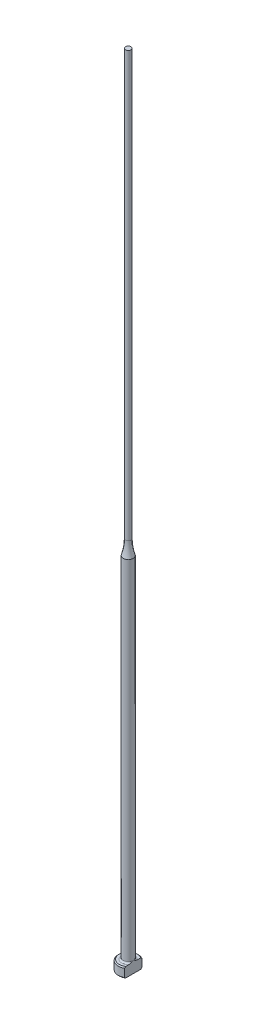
ISO-10303-21;
HEADER;
FILE_DESCRIPTION(('STEP AP214'),'2;1');
FILE_NAME('part.step','',(''),(''),'','','');
FILE_SCHEMA(('AUTOMOTIVE_DESIGN { 1 0 10303 214 1 1 1 1 }'));
ENDSEC;
DATA;
#1=APPLICATION_CONTEXT('core data for automotive mechanical design processes');
#2=APPLICATION_PROTOCOL_DEFINITION('international standard','automotive_design',2000,#1);
#3=PRODUCT_CONTEXT('',#1,'mechanical');
#4=PRODUCT('Part','Part','',(#3));
#5=PRODUCT_RELATED_PRODUCT_CATEGORY('part','',(#4));
#6=PRODUCT_DEFINITION_FORMATION('','',#4);
#7=PRODUCT_DEFINITION_CONTEXT('part definition',#1,'design');
#8=PRODUCT_DEFINITION('design','',#6,#7);
#9=PRODUCT_DEFINITION_SHAPE('','',#8);
#10=(LENGTH_UNIT() NAMED_UNIT(*) SI_UNIT(.MILLI.,.METRE.));
#11=(NAMED_UNIT(*) PLANE_ANGLE_UNIT() SI_UNIT($,.RADIAN.));
#12=(NAMED_UNIT(*) SI_UNIT($,.STERADIAN.) SOLID_ANGLE_UNIT());
#13=UNCERTAINTY_MEASURE_WITH_UNIT(LENGTH_MEASURE(1.E-05),#10,'distance_accuracy_value','');
#14=(GEOMETRIC_REPRESENTATION_CONTEXT(3) GLOBAL_UNCERTAINTY_ASSIGNED_CONTEXT((#13)) GLOBAL_UNIT_ASSIGNED_CONTEXT((#10,
#11,#12)) REPRESENTATION_CONTEXT('',''));
#15=CARTESIAN_POINT('',(0.,0.,0.));
#16=DIRECTION('',(0.,0.,1.));
#17=DIRECTION('',(1.,0.,0.));
#18=AXIS2_PLACEMENT_3D('',#15,#16,#17);
#19=CARTESIAN_POINT('',(-1.99999999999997,2.,0.));
#20=DIRECTION('',(0.,1.,0.));
#21=DIRECTION('',(0.,0.,1.));
#22=AXIS2_PLACEMENT_3D('',#19,#20,#21);
#23=PLANE('',#22);
#24=CARTESIAN_POINT('',(0.,2.,0.));
#25=DIRECTION('',(0.,1.,0.));
#26=DIRECTION('',(0.,0.,1.));
#27=AXIS2_PLACEMENT_3D('',#24,#25,#26);
#28=CIRCLE('',#27,1.79999999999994);
#29=CARTESIAN_POINT('',(0.999999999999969,2.,-1.49666295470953));
#30=VERTEX_POINT('',#29);
#31=CARTESIAN_POINT('',(0.999999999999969,2.,1.49666295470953));
#32=VERTEX_POINT('',#31);
#33=EDGE_CURVE('E187',#30,#32,#28,.T.);
#34=ORIENTED_EDGE('',*,*,#33,.T.);
#35=DIRECTION('',(0.,0.,-1.));
#36=VECTOR('',#35,1.);
#37=CARTESIAN_POINT('',(0.999999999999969,2.,0.));
#38=LINE('',#37,#36);
#39=CARTESIAN_POINT('',(0.999999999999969,2.00000000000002,0.830662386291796));
#40=VERTEX_POINT('',#39);
#41=EDGE_CURVE('E57',#32,#40,#38,.T.);
#42=ORIENTED_EDGE('',*,*,#41,.T.);
#43=CARTESIAN_POINT('',(0.,2.,0.));
#44=DIRECTION('',(0.,1.,0.));
#45=DIRECTION('',(0.,0.,1.));
#46=AXIS2_PLACEMENT_3D('',#43,#44,#45);
#47=CIRCLE('',#46,1.29999999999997);
#48=CARTESIAN_POINT('',(0.999999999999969,2.00000000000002,-0.830662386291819));
#49=VERTEX_POINT('',#48);
#50=EDGE_CURVE('E108',#40,#49,#47,.F.);
#51=ORIENTED_EDGE('',*,*,#50,.T.);
#52=EDGE_CURVE('E137',#49,#30,#38,.T.);
#53=ORIENTED_EDGE('',*,*,#52,.T.);
#54=EDGE_LOOP('',(#34,#42,#51,#53));
#55=FACE_BOUND('',#54,.T.);
#56=ADVANCED_FACE('F32',(#55),#23,.T.);
#57=CARTESIAN_POINT('',(0.,259.958771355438,0.));
#58=DIRECTION('',(0.,1.,0.));
#59=DIRECTION('',(0.,0.,1.));
#60=AXIS2_PLACEMENT_3D('',#57,#58,#59);
#61=CYLINDRICAL_SURFACE('',#60,1.99999999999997);
#62=CARTESIAN_POINT('',(0.,1.79999999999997,0.));
#63=DIRECTION('',(0.,1.,0.));
#64=DIRECTION('',(0.,0.,1.));
#65=AXIS2_PLACEMENT_3D('',#62,#63,#64);
#66=CIRCLE('',#65,1.99999999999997);
#67=CARTESIAN_POINT('',(0.999999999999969,1.79999999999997,1.73205080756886));
#68=VERTEX_POINT('',#67);
#69=CARTESIAN_POINT('',(0.999999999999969,1.79999999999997,-1.73205080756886));
#70=VERTEX_POINT('',#69);
#71=EDGE_CURVE('E105',#68,#70,#66,.F.);
#72=ORIENTED_EDGE('',*,*,#71,.T.);
#73=DIRECTION('',(0.,-1.,0.));
#74=VECTOR('',#73,1.);
#75=CARTESIAN_POINT('',(0.999999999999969,160.,-1.73205080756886));
#76=LINE('',#75,#74);
#77=CARTESIAN_POINT('',(0.999999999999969,0.199999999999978,-1.73205080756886));
#78=VERTEX_POINT('',#77);
#79=EDGE_CURVE('E193',#70,#78,#76,.T.);
#80=ORIENTED_EDGE('',*,*,#79,.T.);
#81=CARTESIAN_POINT('',(0.,0.199999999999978,0.));
#82=DIRECTION('',(0.,-1.,0.));
#83=DIRECTION('',(0.,0.,-1.));
#84=AXIS2_PLACEMENT_3D('',#81,#82,#83);
#85=CIRCLE('',#84,1.99999999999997);
#86=CARTESIAN_POINT('',(0.999999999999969,0.199999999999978,1.73205080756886));
#87=VERTEX_POINT('',#86);
#88=EDGE_CURVE('E100',#78,#87,#85,.F.);
#89=ORIENTED_EDGE('',*,*,#88,.T.);
#90=DIRECTION('',(0.,-1.,0.));
#91=VECTOR('',#90,1.);
#92=CARTESIAN_POINT('',(0.999999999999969,160.,1.73205080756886));
#93=LINE('',#92,#91);
#94=EDGE_CURVE('E93',#68,#87,#93,.T.);
#95=ORIENTED_EDGE('',*,*,#94,.F.);
#96=EDGE_LOOP('',(#72,#80,#89,#95));
#97=FACE_BOUND('',#96,.T.);
#98=ADVANCED_FACE('F158',(#97),#61,.T.);
#99=CARTESIAN_POINT('',(0.,0.,0.));
#100=DIRECTION('',(0.,-1.,0.));
#101=DIRECTION('',(0.,0.,-1.));
#102=AXIS2_PLACEMENT_3D('',#99,#100,#101);
#103=PLANE('',#102);
#104=CARTESIAN_POINT('',(0.,0.,0.));
#105=DIRECTION('',(0.,-1.,0.));
#106=DIRECTION('',(0.,0.,-1.));
#107=AXIS2_PLACEMENT_3D('',#104,#105,#106);
#108=CIRCLE('',#107,1.79999999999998);
#109=CARTESIAN_POINT('',(0.999999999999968,0.,1.49666295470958));
#110=VERTEX_POINT('',#109);
#111=CARTESIAN_POINT('',(0.999999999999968,0.,-1.49666295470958));
#112=VERTEX_POINT('',#111);
#113=EDGE_CURVE('E98',#110,#112,#108,.T.);
#114=ORIENTED_EDGE('',*,*,#113,.T.);
#115=DIRECTION('',(0.,0.,1.));
#116=VECTOR('',#115,1.);
#117=CARTESIAN_POINT('',(0.999999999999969,0.,-1.73205080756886));
#118=LINE('',#117,#116);
#119=EDGE_CURVE('E83',#112,#110,#118,.T.);
#120=ORIENTED_EDGE('',*,*,#119,.T.);
#121=EDGE_LOOP('',(#114,#120));
#122=FACE_BOUND('',#121,.T.);
#123=ADVANCED_FACE('F103',(#122),#103,.T.);
#124=CARTESIAN_POINT('',(0.,2.,0.));
#125=DIRECTION('',(0.,-1.,0.));
#126=DIRECTION('',(0.,0.,-1.));
#127=AXIS2_PLACEMENT_3D('',#124,#125,#126);
#128=CONICAL_SURFACE('',#127,1.79999999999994,0.785398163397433);
#129=ORIENTED_EDGE('',*,*,#71,.F.);
#130=CARTESIAN_POINT('',(0.999999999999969,-0.143084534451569,3.81417299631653));
#131=CARTESIAN_POINT('',(0.999999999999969,-0.0593997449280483,3.72765647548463));
#132=CARTESIAN_POINT('',(0.999999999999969,0.0241940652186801,3.64105173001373));
#133=CARTESIAN_POINT('',(0.999999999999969,0.191148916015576,3.46761616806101));
#134=CARTESIAN_POINT('',(0.999999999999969,0.274509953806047,3.3807853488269));
#135=CARTESIAN_POINT('',(0.999999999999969,0.524249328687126,3.11979400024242));
#136=CARTESIAN_POINT('',(0.999999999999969,0.690198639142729,2.94522254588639));
#137=CARTESIAN_POINT('',(0.999999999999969,1.01697550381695,2.59782670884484));
#138=CARTESIAN_POINT('',(0.999999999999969,1.17783928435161,2.42503661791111));
#139=CARTESIAN_POINT('',(0.999999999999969,1.41669118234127,2.16364984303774));
#140=CARTESIAN_POINT('',(0.999999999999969,1.49589273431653,2.07616357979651));
#141=CARTESIAN_POINT('',(0.999999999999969,1.65313803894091,1.90015721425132));
#142=CARTESIAN_POINT('',(0.999999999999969,1.73118183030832,1.81163714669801));
#143=CARTESIAN_POINT('',(0.999999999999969,1.85567318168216,1.66767927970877));
#144=CARTESIAN_POINT('',(0.999999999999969,1.90265415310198,1.61270332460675));
#145=CARTESIAN_POINT('',(0.999999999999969,1.99577882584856,1.50203557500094));
#146=CARTESIAN_POINT('',(0.999999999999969,2.04192244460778,1.44634371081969));
#147=CARTESIAN_POINT('',(0.999999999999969,2.13356596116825,1.33345480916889));
#148=CARTESIAN_POINT('',(0.999999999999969,2.17905399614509,1.2762481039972));
#149=CARTESIAN_POINT('',(0.999999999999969,2.26844283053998,1.16060976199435));
#150=CARTESIAN_POINT('',(0.999999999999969,2.3123437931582,1.10217825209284));
#151=CARTESIAN_POINT('',(0.999999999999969,2.39853453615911,0.982773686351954));
#152=CARTESIAN_POINT('',(0.999999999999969,2.44078986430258,0.921775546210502));
#153=CARTESIAN_POINT('',(0.999999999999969,2.52187810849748,0.797387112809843));
#154=CARTESIAN_POINT('',(0.999999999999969,2.56070631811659,0.733993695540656));
#155=CARTESIAN_POINT('',(0.999999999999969,2.6324859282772,0.604932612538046));
#156=CARTESIAN_POINT('',(0.999999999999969,2.66550424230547,0.539302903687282));
#157=CARTESIAN_POINT('',(0.999999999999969,2.72301550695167,0.404437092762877));
#158=CARTESIAN_POINT('',(0.999999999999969,2.74753707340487,0.335214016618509));
#159=CARTESIAN_POINT('',(0.999999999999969,2.77407110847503,0.231400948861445));
#160=CARTESIAN_POINT('',(0.999999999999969,2.78110742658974,0.198093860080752));
#161=CARTESIAN_POINT('',(0.999999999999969,2.79200506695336,0.130954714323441));
#162=CARTESIAN_POINT('',(0.999999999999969,2.7958666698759,0.0971227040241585));
#163=CARTESIAN_POINT('',(0.999999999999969,2.80013905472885,0.0293410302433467));
#164=CARTESIAN_POINT('',(0.999999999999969,2.80056046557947,-0.00460794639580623));
#165=CARTESIAN_POINT('',(0.999999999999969,2.79795882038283,-0.0723663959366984));
#166=CARTESIAN_POINT('',(0.999999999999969,2.79493547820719,-0.106175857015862));
#167=CARTESIAN_POINT('',(0.999999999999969,2.78105481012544,-0.206326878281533));
#168=CARTESIAN_POINT('',(0.999999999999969,2.76542146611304,-0.272037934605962));
#169=CARTESIAN_POINT('',(0.999999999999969,2.73477554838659,-0.368312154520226));
#170=CARTESIAN_POINT('',(0.999999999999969,2.72331063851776,-0.40012349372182));
#171=CARTESIAN_POINT('',(0.999999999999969,2.69840546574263,-0.46296441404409));
#172=CARTESIAN_POINT('',(0.999999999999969,2.68496560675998,-0.493994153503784));
#173=CARTESIAN_POINT('',(0.999999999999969,2.64209309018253,-0.586298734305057));
#174=CARTESIAN_POINT('',(0.999999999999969,2.61022871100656,-0.64643570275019));
#175=CARTESIAN_POINT('',(0.999999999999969,2.5422853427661,-0.764304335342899));
#176=CARTESIAN_POINT('',(0.999999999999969,2.50620119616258,-0.822032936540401));
#177=CARTESIAN_POINT('',(0.999999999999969,2.43107084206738,-0.935840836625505));
#178=CARTESIAN_POINT('',(0.999999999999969,2.39201347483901,-0.991912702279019));
#179=CARTESIAN_POINT('',(0.999999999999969,2.31195870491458,-1.10259849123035));
#180=CARTESIAN_POINT('',(0.999999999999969,2.27096226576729,-1.15721311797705));
#181=CARTESIAN_POINT('',(0.999999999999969,2.18701695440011,-1.26606869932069));
#182=CARTESIAN_POINT('',(0.999999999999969,2.14404946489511,-1.32029522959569));
#183=CARTESIAN_POINT('',(0.999999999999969,2.0570505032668,-1.4278898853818));
#184=CARTESIAN_POINT('',(0.999999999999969,2.01301896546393,-1.48125795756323));
#185=CARTESIAN_POINT('',(0.999999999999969,1.87995068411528,-1.64010952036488));
#186=CARTESIAN_POINT('',(0.999999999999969,1.78973357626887,-1.74460261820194));
#187=CARTESIAN_POINT('',(0.999999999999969,1.62290341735,-1.93426834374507));
#188=CARTESIAN_POINT('',(0.999999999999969,1.54658658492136,-2.01970404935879));
#189=CARTESIAN_POINT('',(0.999999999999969,1.39301250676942,-2.18973019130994));
#190=CARTESIAN_POINT('',(0.999999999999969,1.31575523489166,-2.27432060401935));
#191=CARTESIAN_POINT('',(0.999999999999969,1.08283440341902,-2.52732479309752));
#192=CARTESIAN_POINT('',(0.999999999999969,0.926165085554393,-2.69481086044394));
#193=CARTESIAN_POINT('',(0.999999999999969,0.617772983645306,-3.02147252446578));
#194=CARTESIAN_POINT('',(0.999999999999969,0.466111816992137,-3.18070657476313));
#195=CARTESIAN_POINT('',(0.999999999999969,0.238015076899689,-3.41880818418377));
#196=CARTESIAN_POINT('',(0.999999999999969,0.1619245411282,-3.49800657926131));
#197=CARTESIAN_POINT('',(0.999999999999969,0.00955322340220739,-3.65621892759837));
#198=CARTESIAN_POINT('',(0.999999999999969,-0.0667275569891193,-3.73523288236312));
#199=CARTESIAN_POINT('',(0.999999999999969,-0.14308453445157,-3.81417299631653));
#200=B_SPLINE_CURVE_WITH_KNOTS('',3,(#130,#131,#132,#133,#134,#135,#136,#137,#138,#139,#140,
#141,#142,#143,#144,#145,#146,#147,#148,#149,#150,#151,#152,#153,#154,#155,#156,#157,#158,#159,
#160,#161,#162,#163,#164,#165,#166,#167,#168,#169,#170,#171,#172,#173,#174,#175,#176,#177,#178,
#179,#180,#181,#182,#183,#184,#185,#186,#187,#188,#189,#190,#191,#192,#193,#194,#195,#196,#197,
#198,#199),.UNSPECIFIED.,.F.,.F.,(4,2,2,2,2,2,2,2,2,2,2,2,2,2,2,2,2,2,2,2,2,2,2,2,2,2,2,2,2,2,2,
2,2,2,4),(0.,0.36110162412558,0.722207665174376,1.44478731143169,2.15299784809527,
2.5070263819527,2.8610430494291,3.07798416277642,3.29494655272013,3.51418925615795,
3.73340935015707,3.95594813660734,4.17878792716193,4.39886399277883,4.61819150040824,
4.72018864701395,4.82217677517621,4.92384967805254,5.02553102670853,5.22698459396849,
5.32838854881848,5.4297717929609,5.63365200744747,5.837784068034,6.04272417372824,
6.24756349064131,6.45510395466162,6.66265726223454,7.07676259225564,7.42043039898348,
7.76410778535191,8.45210822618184,9.11180822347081,9.44129145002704,9.77077197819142),.UNSPECIFIED.);
#201=EDGE_CURVE('E136',#68,#32,#200,.T.);
#202=ORIENTED_EDGE('',*,*,#201,.T.);
#203=ORIENTED_EDGE('',*,*,#33,.F.);
#204=EDGE_CURVE('E128',#30,#70,#200,.T.);
#205=ORIENTED_EDGE('',*,*,#204,.T.);
#206=EDGE_LOOP('',(#129,#202,#203,#205));
#207=FACE_BOUND('',#206,.T.);
#208=ADVANCED_FACE('F144',(#207),#128,.T.);
#209=CARTESIAN_POINT('',(0.,0.199999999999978,0.));
#210=DIRECTION('',(0.,1.,0.));
#211=DIRECTION('',(0.,0.,1.));
#212=AXIS2_PLACEMENT_3D('',#209,#210,#211);
#213=CONICAL_SURFACE('',#212,1.99999999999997,0.785398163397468);
#214=ORIENTED_EDGE('',*,*,#88,.F.);
#215=CARTESIAN_POINT('',(0.999999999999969,2.14308453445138,-3.81417299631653));
#216=CARTESIAN_POINT('',(0.999999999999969,2.05939974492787,-3.72765647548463));
#217=CARTESIAN_POINT('',(0.999999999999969,1.97580593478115,-3.64105173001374));
#218=CARTESIAN_POINT('',(0.999999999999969,1.80885108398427,-3.46761616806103));
#219=CARTESIAN_POINT('',(0.999999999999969,1.72549004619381,-3.38078534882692));
#220=CARTESIAN_POINT('',(0.999999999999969,1.47575067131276,-3.11979400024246));
#221=CARTESIAN_POINT('',(0.999999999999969,1.30980136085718,-2.94522254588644));
#222=CARTESIAN_POINT('',(0.999999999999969,0.983024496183,-2.5978267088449));
#223=CARTESIAN_POINT('',(0.999999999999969,0.822160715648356,-2.42503661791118));
#224=CARTESIAN_POINT('',(0.999999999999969,0.583308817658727,-2.16364984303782));
#225=CARTESIAN_POINT('',(0.999999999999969,0.50410726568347,-2.0761635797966));
#226=CARTESIAN_POINT('',(0.999999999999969,0.346861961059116,-1.90015721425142));
#227=CARTESIAN_POINT('',(0.999999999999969,0.26881816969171,-1.81163714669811));
#228=CARTESIAN_POINT('',(0.999999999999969,0.144326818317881,-1.66767927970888));
#229=CARTESIAN_POINT('',(0.999999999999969,0.0973458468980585,-1.61270332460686));
#230=CARTESIAN_POINT('',(0.999999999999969,0.00422117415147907,-1.50203557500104));
#231=CARTESIAN_POINT('',(0.999999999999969,-0.0419224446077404,-1.44634371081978));
#232=CARTESIAN_POINT('',(0.999999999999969,-0.133565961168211,-1.33345480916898));
#233=CARTESIAN_POINT('',(0.999999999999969,-0.179053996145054,-1.27624810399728));
#234=CARTESIAN_POINT('',(0.999999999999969,-0.268442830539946,-1.16060976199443));
#235=CARTESIAN_POINT('',(0.999999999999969,-0.31234379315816,-1.10217825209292));
#236=CARTESIAN_POINT('',(0.999999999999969,-0.398534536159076,-0.982773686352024));
#237=CARTESIAN_POINT('',(0.999999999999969,-0.440789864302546,-0.92177554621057));
#238=CARTESIAN_POINT('',(0.999999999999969,-0.521878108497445,-0.797387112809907));
#239=CARTESIAN_POINT('',(0.999999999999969,-0.560706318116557,-0.733993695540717));
#240=CARTESIAN_POINT('',(0.999999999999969,-0.632485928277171,-0.604932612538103));
#241=CARTESIAN_POINT('',(0.999999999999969,-0.665504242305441,-0.539302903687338));
#242=CARTESIAN_POINT('',(0.999999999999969,-0.723015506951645,-0.404437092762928));
#243=CARTESIAN_POINT('',(0.999999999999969,-0.747537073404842,-0.335214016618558));
#244=CARTESIAN_POINT('',(0.999999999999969,-0.774071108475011,-0.231400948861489));
#245=CARTESIAN_POINT('',(0.999999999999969,-0.781107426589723,-0.198093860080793));
#246=CARTESIAN_POINT('',(0.999999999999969,-0.792005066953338,-0.130954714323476));
#247=CARTESIAN_POINT('',(0.999999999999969,-0.795866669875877,-0.0971227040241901));
#248=CARTESIAN_POINT('',(0.999999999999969,-0.800139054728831,-0.0293410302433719));
#249=CARTESIAN_POINT('',(0.999999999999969,-0.80056046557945,0.00460794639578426));
#250=CARTESIAN_POINT('',(0.999999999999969,-0.797958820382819,0.0723663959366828));
#251=CARTESIAN_POINT('',(0.999999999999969,-0.794935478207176,0.106175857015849));
#252=CARTESIAN_POINT('',(0.999999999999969,-0.781054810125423,0.20632687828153));
#253=CARTESIAN_POINT('',(0.999999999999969,-0.765421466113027,0.272037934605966));
#254=CARTESIAN_POINT('',(0.999999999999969,-0.734775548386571,0.36831215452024));
#255=CARTESIAN_POINT('',(0.999999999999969,-0.723310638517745,0.400123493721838));
#256=CARTESIAN_POINT('',(0.999999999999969,-0.698405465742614,0.462964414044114));
#257=CARTESIAN_POINT('',(0.999999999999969,-0.684965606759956,0.493994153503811));
#258=CARTESIAN_POINT('',(0.999999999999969,-0.642093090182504,0.586298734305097));
#259=CARTESIAN_POINT('',(0.999999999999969,-0.610228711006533,0.646435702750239));
#260=CARTESIAN_POINT('',(0.999999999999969,-0.542285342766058,0.764304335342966));
#261=CARTESIAN_POINT('',(0.999999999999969,-0.506201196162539,0.822032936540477));
#262=CARTESIAN_POINT('',(0.999999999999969,-0.431070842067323,0.935840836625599));
#263=CARTESIAN_POINT('',(0.999999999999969,-0.392013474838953,0.991912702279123));
#264=CARTESIAN_POINT('',(0.999999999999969,-0.311958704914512,1.10259849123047));
#265=CARTESIAN_POINT('',(0.999999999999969,-0.270962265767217,1.15721311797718));
#266=CARTESIAN_POINT('',(0.999999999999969,-0.187016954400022,1.26606869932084));
#267=CARTESIAN_POINT('',(0.999999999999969,-0.144049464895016,1.32029522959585));
#268=CARTESIAN_POINT('',(0.999999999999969,-0.0570505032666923,1.42788988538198));
#269=CARTESIAN_POINT('',(0.999999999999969,-0.0130189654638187,1.48125795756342));
#270=CARTESIAN_POINT('',(0.999999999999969,0.120049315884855,1.64010952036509));
#271=CARTESIAN_POINT('',(0.999999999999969,0.21026642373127,1.74460261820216));
#272=CARTESIAN_POINT('',(0.999999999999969,0.37709658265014,1.9342683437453));
#273=CARTESIAN_POINT('',(0.999999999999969,0.453413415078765,2.01970404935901));
#274=CARTESIAN_POINT('',(0.999999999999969,0.606987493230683,2.18973019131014));
#275=CARTESIAN_POINT('',(0.999999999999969,0.684244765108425,2.27432060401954));
#276=CARTESIAN_POINT('',(0.999999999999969,0.917165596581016,2.52732479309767));
#277=CARTESIAN_POINT('',(0.999999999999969,1.07383491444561,2.69481086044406));
#278=CARTESIAN_POINT('',(0.999999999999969,1.38222701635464,3.02147252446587));
#279=CARTESIAN_POINT('',(0.999999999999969,1.53388818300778,3.1807065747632));
#280=CARTESIAN_POINT('',(0.999999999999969,1.76198492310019,3.41880818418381));
#281=CARTESIAN_POINT('',(0.999999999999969,1.83807545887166,3.49800657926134));
#282=CARTESIAN_POINT('',(0.999999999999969,1.99044677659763,3.65621892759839));
#283=CARTESIAN_POINT('',(0.999999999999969,2.06672755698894,3.73523288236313));
#284=CARTESIAN_POINT('',(0.999999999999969,2.14308453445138,3.81417299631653));
#285=B_SPLINE_CURVE_WITH_KNOTS('',3,(#215,#216,#217,#218,#219,#220,#221,#222,#223,#224,#225,
#226,#227,#228,#229,#230,#231,#232,#233,#234,#235,#236,#237,#238,#239,#240,#241,#242,#243,#244,
#245,#246,#247,#248,#249,#250,#251,#252,#253,#254,#255,#256,#257,#258,#259,#260,#261,#262,#263,
#264,#265,#266,#267,#268,#269,#270,#271,#272,#273,#274,#275,#276,#277,#278,#279,#280,#281,#282,
#283,#284),.UNSPECIFIED.,.F.,.F.,(4,2,2,2,2,2,2,2,2,2,2,2,2,2,2,2,2,2,2,2,2,2,2,2,2,2,2,2,2,2,2,
2,2,2,4),(0.,0.36110162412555,0.722207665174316,1.44478731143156,2.15299784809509,
2.5070263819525,2.86104304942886,3.07798416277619,3.2949465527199,3.51418925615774,
3.73340935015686,3.95594813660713,4.17878792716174,4.39886399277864,4.61819150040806,
4.72018864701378,4.82217677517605,4.92384967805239,5.02553102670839,5.22698459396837,
5.32838854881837,5.4297717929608,5.6336520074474,5.83778406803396,6.04272417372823,
6.24756349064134,6.45510395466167,6.66265726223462,7.07676259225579,7.42043039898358,
7.76410778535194,8.45210822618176,9.11180822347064,9.44129145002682,9.77077197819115),.UNSPECIFIED.);
#286=EDGE_CURVE('E86',#78,#112,#285,.T.);
#287=ORIENTED_EDGE('',*,*,#286,.T.);
#288=ORIENTED_EDGE('',*,*,#113,.F.);
#289=EDGE_CURVE('E89',#110,#87,#285,.T.);
#290=ORIENTED_EDGE('',*,*,#289,.T.);
#291=EDGE_LOOP('',(#214,#287,#288,#290));
#292=FACE_BOUND('',#291,.T.);
#293=ADVANCED_FACE('F97',(#292),#213,.T.);
#294=CARTESIAN_POINT('',(0.,2.30000000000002,0.));
#295=DIRECTION('',(0.,1.,0.));
#296=DIRECTION('',(0.,0.,1.));
#297=AXIS2_PLACEMENT_3D('',#294,#295,#296);
#298=TOROIDAL_SURFACE('',#297,1.29999999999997,0.3);
#299=CARTESIAN_POINT('',(0.999999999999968,2.30000000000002,0.));
#300=CARTESIAN_POINT('',(0.999999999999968,2.30000064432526,8.6574445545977E-12));
#301=CARTESIAN_POINT('',(0.999999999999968,2.30000128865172,-9.05742231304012E-08));
#302=CARTESIAN_POINT('',(0.999999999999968,2.30000254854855,-3.98319620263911E-07));
#303=CARTESIAN_POINT('',(0.999999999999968,2.30000316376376,-6.16748313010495E-07));
#304=CARTESIAN_POINT('',(0.999999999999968,2.30000438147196,-1.15047367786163E-06));
#305=CARTESIAN_POINT('',(0.999999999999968,2.30000498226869,-1.46954564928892E-06));
#306=CARTESIAN_POINT('',(0.999999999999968,2.30000613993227,-2.17388585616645E-06));
#307=CARTESIAN_POINT('',(0.999999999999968,2.3000066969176,-2.55896592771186E-06));
#308=CARTESIAN_POINT('',(0.999999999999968,2.30000847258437,-3.89137454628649E-06));
#309=CARTESIAN_POINT('',(0.999999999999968,2.30000962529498,-4.9272569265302E-06));
#310=CARTESIAN_POINT('',(0.999999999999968,2.30001175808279,-7.12255376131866E-06));
#311=CARTESIAN_POINT('',(0.999999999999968,2.30001274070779,-8.27963246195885E-06));
#312=CARTESIAN_POINT('',(0.999999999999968,2.30001619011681,-1.25710396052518E-05));
#313=CARTESIAN_POINT('',(0.999999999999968,2.30001847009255,-1.58589994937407E-05));
#314=CARTESIAN_POINT('',(0.999999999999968,2.3000224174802,-2.25210462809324E-05));
#315=CARTESIAN_POINT('',(0.999999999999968,2.30002411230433,-2.58796667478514E-05));
#316=CARTESIAN_POINT('',(0.999999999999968,2.30003085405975,-3.94941957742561E-05));
#317=CARTESIAN_POINT('',(0.999999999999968,2.30003568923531,-4.98493079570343E-05));
#318=CARTESIAN_POINT('',(0.999999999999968,2.30004388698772,-6.96407730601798E-05));
#319=CARTESIAN_POINT('',(0.999999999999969,2.30004735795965,-7.903098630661E-05));
#320=CARTESIAN_POINT('',(0.999999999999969,2.30007348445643,-0.000144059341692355));
#321=CARTESIAN_POINT('',(0.999999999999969,2.30010510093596,-0.000195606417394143));
#322=CARTESIAN_POINT('',(0.999999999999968,2.30022061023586,-0.000391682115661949));
#323=CARTESIAN_POINT('',(0.999999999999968,2.3002978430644,-0.000539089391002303));
#324=CARTESIAN_POINT('',(0.999999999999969,2.30059433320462,-0.00109591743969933));
#325=CARTESIAN_POINT('',(0.999999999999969,2.30082052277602,-0.00150237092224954));
#326=CARTESIAN_POINT('',(0.999999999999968,2.30171558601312,-0.00311941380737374));
#327=CARTESIAN_POINT('',(0.999999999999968,2.30237677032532,-0.00433326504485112));
#328=CARTESIAN_POINT('',(0.999999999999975,2.31602135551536,-0.0293725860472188));
#329=CARTESIAN_POINT('',(0.99999999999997,2.32909104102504,-0.0531623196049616));
#330=CARTESIAN_POINT('',(0.999999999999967,2.35458080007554,-0.100088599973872));
#331=CARTESIAN_POINT('',(0.999999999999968,2.36700820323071,-0.123221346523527));
#332=CARTESIAN_POINT('',(0.999999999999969,2.39281545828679,-0.172044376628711));
#333=CARTESIAN_POINT('',(0.999999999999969,2.4061616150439,-0.197752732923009));
#334=CARTESIAN_POINT('',(0.999999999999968,2.4323541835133,-0.249714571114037));
#335=CARTESIAN_POINT('',(0.999999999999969,2.44519503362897,-0.27597087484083));
#336=CARTESIAN_POINT('',(0.999999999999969,2.46718175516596,-0.322864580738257));
#337=CARTESIAN_POINT('',(0.999999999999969,2.47650292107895,-0.34341923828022));
#338=CARTESIAN_POINT('',(0.999999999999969,2.49448113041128,-0.384761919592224));
#339=CARTESIAN_POINT('',(0.999999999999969,2.50313958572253,-0.405549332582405));
#340=CARTESIAN_POINT('',(0.999999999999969,2.5276434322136,-0.467585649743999));
#341=CARTESIAN_POINT('',(0.999999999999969,2.54239224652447,-0.509286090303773));
#342=CARTESIAN_POINT('',(0.999999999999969,2.56458900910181,-0.58349816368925));
#343=CARTESIAN_POINT('',(0.999999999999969,2.57294045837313,-0.61573699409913));
#344=CARTESIAN_POINT('',(0.999999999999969,2.58691787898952,-0.682155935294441));
#345=CARTESIAN_POINT('',(0.999999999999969,2.5924232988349,-0.716362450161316));
#346=CARTESIAN_POINT('',(0.999999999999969,2.59932200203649,-0.784996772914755));
#347=CARTESIAN_POINT('',(0.999999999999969,2.60074119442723,-0.819421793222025));
#348=CARTESIAN_POINT('',(0.999999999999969,2.59853032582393,-0.88779225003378));
#349=CARTESIAN_POINT('',(0.999999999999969,2.59495737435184,-0.921738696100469));
#350=CARTESIAN_POINT('',(0.999999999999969,2.58381038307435,-0.977927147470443));
#351=CARTESIAN_POINT('',(0.999999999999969,2.57785171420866,-1.00048693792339));
#352=CARTESIAN_POINT('',(0.999999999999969,2.56267132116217,-1.0445512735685));
#353=CARTESIAN_POINT('',(0.999999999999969,2.55344592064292,-1.06605459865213));
#354=CARTESIAN_POINT('',(0.999999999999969,2.53348156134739,-1.10327564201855));
#355=CARTESIAN_POINT('',(0.999999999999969,2.52335553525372,-1.11931996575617));
#356=CARTESIAN_POINT('',(0.999999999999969,2.50063930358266,-1.1495565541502));
#357=CARTESIAN_POINT('',(0.999999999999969,2.48805327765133,-1.16375189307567));
#358=CARTESIAN_POINT('',(0.999999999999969,2.46313284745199,-1.18709127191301));
#359=CARTESIAN_POINT('',(0.999999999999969,2.45121755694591,-1.19668155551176));
#360=CARTESIAN_POINT('',(0.999999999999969,2.4259612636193,-1.21377371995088));
#361=CARTESIAN_POINT('',(0.999999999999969,2.41262072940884,-1.2212762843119));
#362=CARTESIAN_POINT('',(0.999999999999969,2.38471163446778,-1.23381879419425));
#363=CARTESIAN_POINT('',(0.999999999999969,2.3701356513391,-1.23884240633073));
#364=CARTESIAN_POINT('',(0.999999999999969,2.34029120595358,-1.2460136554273));
#365=CARTESIAN_POINT('',(0.999999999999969,2.32502317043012,-1.24816304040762));
#366=CARTESIAN_POINT('',(0.999999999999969,2.29609418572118,-1.24936303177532));
#367=CARTESIAN_POINT('',(0.999999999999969,2.28244572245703,-1.24873511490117));
#368=CARTESIAN_POINT('',(0.999999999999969,2.25546467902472,-1.24513625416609));
#369=CARTESIAN_POINT('',(0.999999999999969,2.2421320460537,-1.24216570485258));
#370=CARTESIAN_POINT('',(0.999999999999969,2.21644742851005,-1.23414136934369));
#371=CARTESIAN_POINT('',(0.999999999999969,2.20408009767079,-1.22913614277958));
#372=CARTESIAN_POINT('',(0.999999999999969,2.18026539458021,-1.2172891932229));
#373=CARTESIAN_POINT('',(0.999999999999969,2.16881815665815,-1.21044720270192));
#374=CARTESIAN_POINT('',(0.999999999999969,2.14602713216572,-1.19450929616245));
#375=CARTESIAN_POINT('',(0.999999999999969,2.1347876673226,-1.18526487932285));
#376=CARTESIAN_POINT('',(0.999999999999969,2.11372805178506,-1.16528066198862));
#377=CARTESIAN_POINT('',(0.999999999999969,2.1039092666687,-1.15453944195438));
#378=CARTESIAN_POINT('',(0.999999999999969,2.08131380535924,-1.12639326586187));
#379=CARTESIAN_POINT('',(0.999999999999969,2.06941227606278,-1.10828305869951));
#380=CARTESIAN_POINT('',(0.999999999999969,2.04871157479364,-1.07041295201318));
#381=CARTESIAN_POINT('',(0.999999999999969,2.03991325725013,-1.05065259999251));
#382=CARTESIAN_POINT('',(0.999999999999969,2.02219264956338,-1.00203188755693));
#383=CARTESIAN_POINT('',(0.999999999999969,2.01461756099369,-0.972682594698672));
#384=CARTESIAN_POINT('',(0.999999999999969,2.00410660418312,-0.912914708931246));
#385=CARTESIAN_POINT('',(0.999999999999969,2.00122174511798,-0.882487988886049));
#386=CARTESIAN_POINT('',(0.999999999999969,1.99886242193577,-0.80318909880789));
#387=CARTESIAN_POINT('',(0.999999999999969,2.0024814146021,-0.754226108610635));
#388=CARTESIAN_POINT('',(0.999999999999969,2.01327071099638,-0.682724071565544));
#389=CARTESIAN_POINT('',(0.999999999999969,2.01762186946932,-0.659663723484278));
#390=CARTESIAN_POINT('',(0.999999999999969,2.02775671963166,-0.613959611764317));
#391=CARTESIAN_POINT('',(0.999999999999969,2.03353398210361,-0.59131445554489));
#392=CARTESIAN_POINT('',(0.999999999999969,2.05232003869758,-0.525222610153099));
#393=CARTESIAN_POINT('',(0.999999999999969,2.0670175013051,-0.482256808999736));
#394=CARTESIAN_POINT('',(0.999999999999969,2.09166172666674,-0.418361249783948));
#395=CARTESIAN_POINT('',(0.999999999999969,2.10040936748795,-0.396945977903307));
#396=CARTESIAN_POINT('',(0.999999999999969,2.11862724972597,-0.354367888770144));
#397=CARTESIAN_POINT('',(0.999999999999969,2.12809902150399,-0.33320572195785));
#398=CARTESIAN_POINT('',(0.999999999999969,2.15054796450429,-0.284809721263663));
#399=CARTESIAN_POINT('',(0.999999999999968,2.16372144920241,-0.257667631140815));
#400=CARTESIAN_POINT('',(0.999999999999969,2.19063957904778,-0.203972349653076));
#401=CARTESIAN_POINT('',(0.999999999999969,2.20437810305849,-0.177416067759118));
#402=CARTESIAN_POINT('',(0.999999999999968,2.23096755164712,-0.127000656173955));
#403=CARTESIAN_POINT('',(0.999999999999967,2.2437812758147,-0.103121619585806));
#404=CARTESIAN_POINT('',(0.99999999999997,2.27007504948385,-0.0546869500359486));
#405=CARTESIAN_POINT('',(0.999999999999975,2.28356304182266,-0.0301354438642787));
#406=CARTESIAN_POINT('',(0.999999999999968,2.29762327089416,-0.00433318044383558));
#407=CARTESIAN_POINT('',(0.999999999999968,2.29828450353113,-0.00311924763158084));
#408=CARTESIAN_POINT('',(0.999999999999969,2.29917957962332,-0.0015021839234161));
#409=CARTESIAN_POINT('',(0.999999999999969,2.2994057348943,-0.0010957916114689));
#410=CARTESIAN_POINT('',(0.999999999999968,2.29970218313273,-0.000539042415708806));
#411=CARTESIAN_POINT('',(0.999999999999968,2.29977940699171,-0.000391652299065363));
#412=CARTESIAN_POINT('',(0.999999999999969,2.29989490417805,-0.000195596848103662));
#413=CARTESIAN_POINT('',(0.999999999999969,2.2999265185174,-0.000144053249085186));
#414=CARTESIAN_POINT('',(0.999999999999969,2.29995264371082,-7.90290824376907E-05));
#415=CARTESIAN_POINT('',(0.999999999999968,2.29995611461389,-6.96391975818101E-05));
#416=CARTESIAN_POINT('',(0.999999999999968,2.29996431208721,-4.98484228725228E-05));
#417=CARTESIAN_POINT('',(0.999999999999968,2.29996914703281,-3.94936645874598E-05));
#418=CARTESIAN_POINT('',(0.999999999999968,2.29997588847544,-2.587953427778E-05));
#419=CARTESIAN_POINT('',(0.999999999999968,2.29997758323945,-2.25209724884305E-05));
#420=CARTESIAN_POINT('',(0.999999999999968,2.29998153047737,-1.58590310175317E-05));
#421=CARTESIAN_POINT('',(0.999999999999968,2.29998381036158,-1.25711163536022E-05));
#422=CARTESIAN_POINT('',(0.999999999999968,2.29998725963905,-8.27974911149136E-06));
#423=CARTESIAN_POINT('',(0.999999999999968,2.29998824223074,-7.122675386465E-06));
#424=CARTESIAN_POINT('',(0.999999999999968,2.29999037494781,-4.92738159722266E-06));
#425=CARTESIAN_POINT('',(0.999999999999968,2.29999152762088,-3.89149712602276E-06));
#426=CARTESIAN_POINT('',(0.999999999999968,2.29999330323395,-2.5590774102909E-06));
#427=CARTESIAN_POINT('',(0.999999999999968,2.29999386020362,-2.17399250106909E-06));
#428=CARTESIAN_POINT('',(0.999999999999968,2.29999501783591,-1.4696398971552E-06));
#429=CARTESIAN_POINT('',(0.999999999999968,2.299995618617,-1.15056035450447E-06));
#430=CARTESIAN_POINT('',(0.999999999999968,2.29999683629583,-6.16816558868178E-07));
#431=CARTESIAN_POINT('',(0.999999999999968,2.29999745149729,-3.98377208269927E-07));
#432=CARTESIAN_POINT('',(0.999999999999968,2.29999871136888,-9.06063088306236E-08));
#433=CARTESIAN_POINT('',(0.999999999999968,2.29999935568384,-8.657323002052E-12));
#434=CARTESIAN_POINT('',(0.999999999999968,2.30000000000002,0.));
#435=B_SPLINE_CURVE_WITH_KNOTS('',3,(#299,#300,#301,#302,#303,#304,#305,#306,#307,#308,#309,
#310,#311,#312,#313,#314,#315,#316,#317,#318,#319,#320,#321,#322,#323,#324,#325,#326,#327,#328,
#329,#330,#331,#332,#333,#334,#335,#336,#337,#338,#339,#340,#341,#342,#343,#344,#345,#346,#347,
#348,#349,#350,#351,#352,#353,#354,#355,#356,#357,#358,#359,#360,#361,#362,#363,#364,#365,#366,
#367,#368,#369,#370,#371,#372,#373,#374,#375,#376,#377,#378,#379,#380,#381,#382,#383,#384,#385,
#386,#387,#388,#389,#390,#391,#392,#393,#394,#395,#396,#397,#398,#399,#400,#401,#402,#403,#404,
#405,#406,#407,#408,#409,#410,#411,#412,#413,#414,#415,#416,#417,#418,#419,#420,#421,#422,#423,
#424,#425,#426,#427,#428,#429,#430,#431,#432,#433,#434),.UNSPECIFIED.,.T.,.F.,(4,2,2,2,2,2,2,2,
2,2,2,2,2,2,2,2,2,2,2,2,2,2,2,2,2,2,2,2,2,2,2,2,2,2,2,2,2,2,2,2,2,2,2,2,2,2,2,2,2,2,2,2,2,2,2,2,
2,2,2,2,2,2,2,2,2,2,2,4),(0.,1.93088000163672E-06,3.88121487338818E-06,5.91576027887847E-06,
7.94459959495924E-06,1.25713540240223E-05,1.71213138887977E-05,2.9075120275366E-05,
4.0350817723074E-05,7.46190414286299E-05,0.000104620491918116,0.00028499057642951,
0.000785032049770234,0.00217951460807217,0.00632720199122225,0.0877445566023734,
0.166524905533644,0.253417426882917,0.341089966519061,0.408787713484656,0.476336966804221,
0.608850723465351,0.708652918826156,0.812393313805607,0.915474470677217,1.01738599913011,
1.08718721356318,1.15706723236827,1.21377727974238,1.27039179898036,1.31609373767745,
1.36178069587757,1.40776478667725,1.4537208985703,1.49450576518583,1.5352837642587,
1.57514089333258,1.61500383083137,1.65849635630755,1.70203041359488,1.76667915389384,
1.83134568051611,1.92177629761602,2.0131839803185,2.15955153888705,2.22993031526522,
2.29999742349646,2.43600819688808,2.50540041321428,2.57494356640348,2.66544006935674,
2.75513178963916,2.83643278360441,2.92045687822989,2.92460484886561,2.92599912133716,
2.926499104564,2.92667946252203,2.92670946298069,2.92674372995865,2.92675500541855,
2.92676695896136,2.92677150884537,2.92677613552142,2.92677816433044,2.92678019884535,
2.92678214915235,2.92678408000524),.UNSPECIFIED.);
#436=CARTESIAN_POINT('',(0.999999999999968,2.30000000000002,0.));
#437=VERTEX_POINT('',#436);
#438=EDGE_CURVE('E11',#49,#437,#435,.T.);
#439=ORIENTED_EDGE('',*,*,#438,.F.);
#440=ORIENTED_EDGE('',*,*,#50,.F.);
#441=CARTESIAN_POINT('',(0.999999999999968,2.30000000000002,0.));
#442=CARTESIAN_POINT('',(0.999999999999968,2.29999935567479,-8.65741696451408E-12));
#443=CARTESIAN_POINT('',(0.999999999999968,2.29999871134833,9.05742231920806E-08));
#444=CARTESIAN_POINT('',(0.999999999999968,2.2999974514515,3.98319620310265E-07));
#445=CARTESIAN_POINT('',(0.999999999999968,2.29999683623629,6.16748313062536E-07));
#446=CARTESIAN_POINT('',(0.999999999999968,2.29999561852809,1.15047367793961E-06));
#447=CARTESIAN_POINT('',(0.999999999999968,2.29999501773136,1.46954564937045E-06));
#448=CARTESIAN_POINT('',(0.999999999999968,2.29999386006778,2.17388585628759E-06));
#449=CARTESIAN_POINT('',(0.999999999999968,2.29999330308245,2.55896592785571E-06));
#450=CARTESIAN_POINT('',(0.999999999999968,2.29999152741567,3.89137454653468E-06));
#451=CARTESIAN_POINT('',(0.999999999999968,2.29999037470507,4.92725692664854E-06));
#452=CARTESIAN_POINT('',(0.999999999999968,2.29998824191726,7.12255376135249E-06));
#453=CARTESIAN_POINT('',(0.999999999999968,2.29998725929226,8.27963246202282E-06));
#454=CARTESIAN_POINT('',(0.999999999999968,2.29998380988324,1.25710396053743E-05));
#455=CARTESIAN_POINT('',(0.999999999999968,2.2999815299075,1.58589994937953E-05));
#456=CARTESIAN_POINT('',(0.999999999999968,2.29997758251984,2.25210462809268E-05));
#457=CARTESIAN_POINT('',(0.999999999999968,2.29997588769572,2.58796667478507E-05));
#458=CARTESIAN_POINT('',(0.999999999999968,2.29996914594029,3.94941957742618E-05));
#459=CARTESIAN_POINT('',(0.999999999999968,2.29996431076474,4.98493079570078E-05));
#460=CARTESIAN_POINT('',(0.999999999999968,2.29995611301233,6.96407730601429E-05));
#461=CARTESIAN_POINT('',(0.999999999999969,2.2999526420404,7.90309863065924E-05));
#462=CARTESIAN_POINT('',(0.999999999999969,2.29992651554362,0.000144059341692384));
#463=CARTESIAN_POINT('',(0.999999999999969,2.29989489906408,0.000195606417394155));
#464=CARTESIAN_POINT('',(0.999999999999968,2.29977938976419,0.000391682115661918));
#465=CARTESIAN_POINT('',(0.999999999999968,2.29970215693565,0.000539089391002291));
#466=CARTESIAN_POINT('',(0.999999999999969,2.29940566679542,0.00109591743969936));
#467=CARTESIAN_POINT('',(0.999999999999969,2.29917947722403,0.00150237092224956));
#468=CARTESIAN_POINT('',(0.999999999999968,2.29828441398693,0.0031194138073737));
#469=CARTESIAN_POINT('',(0.999999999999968,2.29762322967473,0.0043332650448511));
#470=CARTESIAN_POINT('',(0.999999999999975,2.28397864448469,0.0293725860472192));
#471=CARTESIAN_POINT('',(0.99999999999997,2.27090895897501,0.0531623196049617));
#472=CARTESIAN_POINT('',(0.999999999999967,2.24541919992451,0.100088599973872));
#473=CARTESIAN_POINT('',(0.999999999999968,2.23299179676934,0.123221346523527));
#474=CARTESIAN_POINT('',(0.999999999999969,2.20718454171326,0.172044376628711));
#475=CARTESIAN_POINT('',(0.999999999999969,2.19383838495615,0.197752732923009));
#476=CARTESIAN_POINT('',(0.999999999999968,2.16764581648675,0.249714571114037));
#477=CARTESIAN_POINT('',(0.999999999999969,2.15480496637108,0.27597087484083));
#478=CARTESIAN_POINT('',(0.999999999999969,2.13281824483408,0.322864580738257));
#479=CARTESIAN_POINT('',(0.999999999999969,2.1234970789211,0.34341923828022));
#480=CARTESIAN_POINT('',(0.999999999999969,2.10551886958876,0.384761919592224));
#481=CARTESIAN_POINT('',(0.999999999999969,2.09686041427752,0.405549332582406));
#482=CARTESIAN_POINT('',(0.999999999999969,2.07235656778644,0.467585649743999));
#483=CARTESIAN_POINT('',(0.999999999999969,2.05760775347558,0.509286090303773));
#484=CARTESIAN_POINT('',(0.999999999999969,2.03541099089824,0.58349816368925));
#485=CARTESIAN_POINT('',(0.999999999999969,2.02705954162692,0.61573699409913));
#486=CARTESIAN_POINT('',(0.999999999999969,2.01308212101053,0.682155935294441));
#487=CARTESIAN_POINT('',(0.999999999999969,2.00757670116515,0.716362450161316));
#488=CARTESIAN_POINT('',(0.999999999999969,2.00067799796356,0.784996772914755));
#489=CARTESIAN_POINT('',(0.999999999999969,1.99925880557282,0.819421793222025));
#490=CARTESIAN_POINT('',(0.999999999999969,2.00146967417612,0.88779225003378));
#491=CARTESIAN_POINT('',(0.999999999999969,2.00504262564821,0.921738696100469));
#492=CARTESIAN_POINT('',(0.999999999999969,2.0161896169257,0.977927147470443));
#493=CARTESIAN_POINT('',(0.999999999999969,2.02214828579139,1.00048693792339));
#494=CARTESIAN_POINT('',(0.999999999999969,2.03732867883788,1.0445512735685));
#495=CARTESIAN_POINT('',(0.999999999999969,2.04655407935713,1.06605459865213));
#496=CARTESIAN_POINT('',(0.999999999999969,2.06651843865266,1.10327564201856));
#497=CARTESIAN_POINT('',(0.999999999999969,2.07664446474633,1.11931996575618));
#498=CARTESIAN_POINT('',(0.999999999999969,2.09936069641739,1.14955655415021));
#499=CARTESIAN_POINT('',(0.999999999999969,2.11194672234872,1.16375189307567));
#500=CARTESIAN_POINT('',(0.999999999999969,2.13686715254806,1.18709127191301));
#501=CARTESIAN_POINT('',(0.999999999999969,2.14878244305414,1.19668155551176));
#502=CARTESIAN_POINT('',(0.999999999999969,2.17403873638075,1.21377371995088));
#503=CARTESIAN_POINT('',(0.999999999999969,2.18737927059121,1.2212762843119));
#504=CARTESIAN_POINT('',(0.999999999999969,2.21528836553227,1.23381879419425));
#505=CARTESIAN_POINT('',(0.999999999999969,2.22986434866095,1.23884240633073));
#506=CARTESIAN_POINT('',(0.999999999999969,2.25970879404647,1.2460136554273));
#507=CARTESIAN_POINT('',(0.999999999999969,2.27497682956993,1.24816304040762));
#508=CARTESIAN_POINT('',(0.999999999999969,2.30390581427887,1.24936303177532));
#509=CARTESIAN_POINT('',(0.999999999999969,2.31755427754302,1.24873511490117));
#510=CARTESIAN_POINT('',(0.999999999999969,2.34453532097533,1.24513625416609));
#511=CARTESIAN_POINT('',(0.999999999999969,2.35786795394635,1.24216570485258));
#512=CARTESIAN_POINT('',(0.999999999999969,2.38355257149,1.23414136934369));
#513=CARTESIAN_POINT('',(0.999999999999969,2.39591990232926,1.22913614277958));
#514=CARTESIAN_POINT('',(0.999999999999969,2.41973460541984,1.2172891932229));
#515=CARTESIAN_POINT('',(0.999999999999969,2.4311818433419,1.21044720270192));
#516=CARTESIAN_POINT('',(0.999999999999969,2.45397286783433,1.19450929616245));
#517=CARTESIAN_POINT('',(0.999999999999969,2.46521233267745,1.18526487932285));
#518=CARTESIAN_POINT('',(0.999999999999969,2.48627194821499,1.16528066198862));
#519=CARTESIAN_POINT('',(0.999999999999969,2.49609073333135,1.15453944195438));
#520=CARTESIAN_POINT('',(0.999999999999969,2.51868619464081,1.12639326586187));
#521=CARTESIAN_POINT('',(0.999999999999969,2.53058772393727,1.10828305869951));
#522=CARTESIAN_POINT('',(0.999999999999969,2.55128842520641,1.07041295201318));
#523=CARTESIAN_POINT('',(0.999999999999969,2.56008674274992,1.05065259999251));
#524=CARTESIAN_POINT('',(0.999999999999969,2.57780735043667,1.00203188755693));
#525=CARTESIAN_POINT('',(0.999999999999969,2.58538243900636,0.972682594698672));
#526=CARTESIAN_POINT('',(0.999999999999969,2.59589339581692,0.912914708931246));
#527=CARTESIAN_POINT('',(0.999999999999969,2.59877825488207,0.882487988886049));
#528=CARTESIAN_POINT('',(0.999999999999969,2.60113757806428,0.80318909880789));
#529=CARTESIAN_POINT('',(0.999999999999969,2.59751858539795,0.754226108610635));
#530=CARTESIAN_POINT('',(0.999999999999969,2.58672928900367,0.682724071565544));
#531=CARTESIAN_POINT('',(0.999999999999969,2.58237813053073,0.659663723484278));
#532=CARTESIAN_POINT('',(0.999999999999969,2.57224328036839,0.613959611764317));
#533=CARTESIAN_POINT('',(0.999999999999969,2.56646601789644,0.59131445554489));
#534=CARTESIAN_POINT('',(0.999999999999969,2.54767996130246,0.525222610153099));
#535=CARTESIAN_POINT('',(0.999999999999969,2.53298249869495,0.482256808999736));
#536=CARTESIAN_POINT('',(0.999999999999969,2.50833827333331,0.418361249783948));
#537=CARTESIAN_POINT('',(0.999999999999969,2.49959063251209,0.396945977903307));
#538=CARTESIAN_POINT('',(0.999999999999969,2.48137275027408,0.354367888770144));
#539=CARTESIAN_POINT('',(0.999999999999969,2.47190097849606,0.33320572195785));
#540=CARTESIAN_POINT('',(0.999999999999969,2.44945203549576,0.284809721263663));
#541=CARTESIAN_POINT('',(0.999999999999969,2.43627855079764,0.257667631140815));
#542=CARTESIAN_POINT('',(0.999999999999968,2.40936042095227,0.203972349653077));
#543=CARTESIAN_POINT('',(0.999999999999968,2.39562189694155,0.177416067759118));
#544=CARTESIAN_POINT('',(0.999999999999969,2.36903244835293,0.127000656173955));
#545=CARTESIAN_POINT('',(0.999999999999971,2.35621872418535,0.103121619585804));
#546=CARTESIAN_POINT('',(0.999999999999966,2.32992495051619,0.0546869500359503));
#547=CARTESIAN_POINT('',(0.999999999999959,2.31643695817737,0.0301354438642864));
#548=CARTESIAN_POINT('',(0.999999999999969,2.30237672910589,0.0043331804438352));
#549=CARTESIAN_POINT('',(0.99999999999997,2.30171549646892,0.00311924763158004));
#550=CARTESIAN_POINT('',(0.999999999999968,2.30082042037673,0.00150218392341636));
#551=CARTESIAN_POINT('',(0.999999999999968,2.30059426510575,0.00109579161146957));
#552=CARTESIAN_POINT('',(0.999999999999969,2.30029781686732,0.000539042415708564));
#553=CARTESIAN_POINT('',(0.999999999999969,2.30022059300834,0.000391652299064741));
#554=CARTESIAN_POINT('',(0.999999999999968,2.300105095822,0.000195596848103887));
#555=CARTESIAN_POINT('',(0.999999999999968,2.30007348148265,0.000144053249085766));
#556=CARTESIAN_POINT('',(0.999999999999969,2.30004735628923,7.90290824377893E-05));
#557=CARTESIAN_POINT('',(0.999999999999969,2.30004388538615,6.96391975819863E-05));
#558=CARTESIAN_POINT('',(0.999999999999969,2.30003568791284,4.98484228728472E-05));
#559=CARTESIAN_POINT('',(0.999999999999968,2.30003085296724,3.9493664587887E-05));
#560=CARTESIAN_POINT('',(0.999999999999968,2.30002411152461,2.5879534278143E-05));
#561=CARTESIAN_POINT('',(0.999999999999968,2.3000224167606,2.25209724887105E-05));
#562=CARTESIAN_POINT('',(0.999999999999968,2.30001846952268,1.58590310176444E-05));
#563=CARTESIAN_POINT('',(0.999999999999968,2.30001618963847,1.25711163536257E-05));
#564=CARTESIAN_POINT('',(0.999999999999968,2.300012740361,8.27974911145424E-06));
#565=CARTESIAN_POINT('',(0.999999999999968,2.30001175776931,7.12267538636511E-06));
#566=CARTESIAN_POINT('',(0.999999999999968,2.30000962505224,4.92738159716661E-06));
#567=CARTESIAN_POINT('',(0.999999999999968,2.30000847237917,3.89149712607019E-06));
#568=CARTESIAN_POINT('',(0.999999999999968,2.3000066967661,2.55907741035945E-06));
#569=CARTESIAN_POINT('',(0.999999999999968,2.30000613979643,2.17399250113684E-06));
#570=CARTESIAN_POINT('',(0.999999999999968,2.30000498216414,1.46963989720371E-06));
#571=CARTESIAN_POINT('',(0.999999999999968,2.30000438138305,1.15056035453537E-06));
#572=CARTESIAN_POINT('',(0.999999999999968,2.30000316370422,6.16816558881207E-07));
#573=CARTESIAN_POINT('',(0.999999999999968,2.30000254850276,3.98377208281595E-07));
#574=CARTESIAN_POINT('',(0.999999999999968,2.30000128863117,9.06063088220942E-08));
#575=CARTESIAN_POINT('',(0.999999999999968,2.30000064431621,8.65729541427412E-12));
#576=CARTESIAN_POINT('',(0.999999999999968,2.30000000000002,0.));
#577=B_SPLINE_CURVE_WITH_KNOTS('',3,(#441,#442,#443,#444,#445,#446,#447,#448,#449,#450,#451,
#452,#453,#454,#455,#456,#457,#458,#459,#460,#461,#462,#463,#464,#465,#466,#467,#468,#469,#470,
#471,#472,#473,#474,#475,#476,#477,#478,#479,#480,#481,#482,#483,#484,#485,#486,#487,#488,#489,
#490,#491,#492,#493,#494,#495,#496,#497,#498,#499,#500,#501,#502,#503,#504,#505,#506,#507,#508,
#509,#510,#511,#512,#513,#514,#515,#516,#517,#518,#519,#520,#521,#522,#523,#524,#525,#526,#527,
#528,#529,#530,#531,#532,#533,#534,#535,#536,#537,#538,#539,#540,#541,#542,#543,#544,#545,#546,
#547,#548,#549,#550,#551,#552,#553,#554,#555,#556,#557,#558,#559,#560,#561,#562,#563,#564,#565,
#566,#567,#568,#569,#570,#571,#572,#573,#574,#575,#576),.UNSPECIFIED.,.T.,.F.,(4,2,2,2,2,2,2,2,
2,2,2,2,2,2,2,2,2,2,2,2,2,2,2,2,2,2,2,2,2,2,2,2,2,2,2,2,2,2,2,2,2,2,2,2,2,2,2,2,2,2,2,2,2,2,2,2,
2,2,2,2,2,2,2,2,2,2,2,4),(0.,1.93088000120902E-06,3.88121487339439E-06,5.91576027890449E-06,
7.94459959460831E-06,1.2571354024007E-05,1.71213138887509E-05,2.90751202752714E-05,
4.03508177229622E-05,7.46190414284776E-05,0.000104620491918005,0.000284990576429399,
0.000785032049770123,0.00217951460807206,0.00632720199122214,0.0877445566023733,
0.166524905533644,0.253417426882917,0.341089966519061,0.408787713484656,0.476336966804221,
0.608850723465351,0.708652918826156,0.812393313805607,0.915474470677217,1.01738599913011,
1.08718721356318,1.15706723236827,1.21377727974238,1.27039179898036,1.31609373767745,
1.36178069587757,1.40776478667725,1.4537208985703,1.49450576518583,1.5352837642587,
1.57514089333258,1.61500383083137,1.65849635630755,1.70203041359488,1.76667915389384,
1.83134568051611,1.92177629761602,2.0131839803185,2.15955153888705,2.22993031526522,
2.29999742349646,2.43600819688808,2.50540041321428,2.57494356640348,2.66544006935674,
2.75513178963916,2.83643278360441,2.92045687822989,2.92460484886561,2.92599912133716,
2.926499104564,2.92667946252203,2.92670946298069,2.92674372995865,2.92675500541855,
2.92676695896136,2.92677150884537,2.92677613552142,2.92677816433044,2.92678019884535,
2.92678214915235,2.92678408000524),.UNSPECIFIED.);
#578=EDGE_CURVE('E46',#437,#40,#577,.T.);
#579=ORIENTED_EDGE('',*,*,#578,.F.);
#580=CARTESIAN_POINT('',(0.,2.30000000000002,0.));
#581=DIRECTION('',(0.,1.,0.));
#582=DIRECTION('',(0.,0.,1.));
#583=AXIS2_PLACEMENT_3D('',#580,#581,#582);
#584=CIRCLE('',#583,0.999999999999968);
#585=EDGE_CURVE('E104',#437,#437,#584,.T.);
#586=ORIENTED_EDGE('',*,*,#585,.F.);
#587=EDGE_LOOP('',(#439,#440,#579,#586));
#588=FACE_BOUND('',#587,.T.);
#589=ADVANCED_FACE('F34',(#588),#298,.F.);
#590=CARTESIAN_POINT('',(-0.549999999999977,160.,0.));
#591=DIRECTION('',(0.,1.,0.));
#592=DIRECTION('',(0.,0.,1.));
#593=AXIS2_PLACEMENT_3D('',#590,#591,#592);
#594=PLANE('',#593);
#595=CARTESIAN_POINT('',(0.,160.,0.));
#596=DIRECTION('',(0.,1.,0.));
#597=DIRECTION('',(0.,0.,1.));
#598=AXIS2_PLACEMENT_3D('',#595,#596,#597);
#599=CIRCLE('',#598,0.549999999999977);
#600=CARTESIAN_POINT('',(0.,160.,0.549999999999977));
#601=VERTEX_POINT('',#600);
#602=EDGE_CURVE('E186',#601,#601,#599,.T.);
#603=ORIENTED_EDGE('',*,*,#602,.T.);
#604=EDGE_LOOP('',(#603));
#605=FACE_BOUND('',#604,.T.);
#606=ADVANCED_FACE('F149',(#605),#594,.T.);
#607=CARTESIAN_POINT('',(0.,259.958771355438,0.));
#608=DIRECTION('',(0.,1.,0.));
#609=DIRECTION('',(0.,0.,1.));
#610=AXIS2_PLACEMENT_3D('',#607,#608,#609);
#611=CYLINDRICAL_SURFACE('',#610,0.549999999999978);
#612=CARTESIAN_POINT('',(0.,75.,0.));
#613=DIRECTION('',(0.,1.,0.));
#614=DIRECTION('',(0.,0.,1.));
#615=AXIS2_PLACEMENT_3D('',#612,#613,#614);
#616=CIRCLE('',#615,0.549999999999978);
#617=CARTESIAN_POINT('',(0.,75.,0.549999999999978));
#618=VERTEX_POINT('',#617);
#619=EDGE_CURVE('E183',#618,#618,#616,.T.);
#620=ORIENTED_EDGE('',*,*,#619,.T.);
#621=EDGE_LOOP('',(#620));
#622=FACE_BOUND('',#621,.T.);
#623=ORIENTED_EDGE('',*,*,#602,.F.);
#624=EDGE_LOOP('',(#623));
#625=FACE_BOUND('',#624,.T.);
#626=ADVANCED_FACE('F172',(#622,#625),#611,.T.);
#627=CARTESIAN_POINT('',(0.,75.,0.));
#628=DIRECTION('',(0.,1.,0.));
#629=DIRECTION('',(0.,0.,1.));
#630=AXIS2_PLACEMENT_3D('',#627,#628,#629);
#631=TOROIDAL_SURFACE('',#630,10.55,10.);
#632=CARTESIAN_POINT('',(0.,72.0339420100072,0.));
#633=DIRECTION('',(0.,1.,0.));
#634=DIRECTION('',(0.,0.,1.));
#635=AXIS2_PLACEMENT_3D('',#632,#633,#634);
#636=CIRCLE('',#635,0.999999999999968);
#637=CARTESIAN_POINT('',(0.,72.0339420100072,0.999999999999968));
#638=VERTEX_POINT('',#637);
#639=EDGE_CURVE('E101',#638,#638,#636,.T.);
#640=ORIENTED_EDGE('',*,*,#639,.T.);
#641=EDGE_LOOP('',(#640));
#642=FACE_BOUND('',#641,.T.);
#643=ORIENTED_EDGE('',*,*,#619,.F.);
#644=EDGE_LOOP('',(#643));
#645=FACE_BOUND('',#644,.T.);
#646=ADVANCED_FACE('F169',(#642,#645),#631,.F.);
#647=CARTESIAN_POINT('',(0.,259.958771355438,0.));
#648=DIRECTION('',(0.,1.,0.));
#649=DIRECTION('',(0.,0.,1.));
#650=AXIS2_PLACEMENT_3D('',#647,#648,#649);
#651=CYLINDRICAL_SURFACE('',#650,0.999999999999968);
#652=ORIENTED_EDGE('',*,*,#585,.T.);
#653=EDGE_LOOP('',(#652));
#654=FACE_BOUND('',#653,.T.);
#655=ORIENTED_EDGE('',*,*,#639,.F.);
#656=EDGE_LOOP('',(#655));
#657=FACE_BOUND('',#656,.T.);
#658=ADVANCED_FACE('F122',(#654,#657),#651,.T.);
#659=CARTESIAN_POINT('',(0.999999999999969,160.,-1.73205080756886));
#660=DIRECTION('',(1.,0.,0.));
#661=DIRECTION('',(0.,0.,-1.));
#662=AXIS2_PLACEMENT_3D('',#659,#660,#661);
#663=PLANE('',#662);
#664=ORIENTED_EDGE('',*,*,#79,.F.);
#665=ORIENTED_EDGE('',*,*,#204,.F.);
#666=ORIENTED_EDGE('',*,*,#52,.F.);
#667=ORIENTED_EDGE('',*,*,#438,.T.);
#668=ORIENTED_EDGE('',*,*,#578,.T.);
#669=ORIENTED_EDGE('',*,*,#41,.F.);
#670=ORIENTED_EDGE('',*,*,#201,.F.);
#671=ORIENTED_EDGE('',*,*,#94,.T.);
#672=ORIENTED_EDGE('',*,*,#289,.F.);
#673=ORIENTED_EDGE('',*,*,#119,.F.);
#674=ORIENTED_EDGE('',*,*,#286,.F.);
#675=EDGE_LOOP('',(#664,#665,#666,#667,#668,#669,#670,#671,#672,#673,#674));
#676=FACE_BOUND('',#675,.T.);
#677=ADVANCED_FACE('F85',(#676),#663,.T.);
#678=CLOSED_SHELL('',(#56,#98,#123,#208,#293,#589,#606,#626,#646,#658,#677));
#679=MANIFOLD_SOLID_BREP('B2',#678);
#680=ADVANCED_BREP_SHAPE_REPRESENTATION('',(#18,#679),#14);
#681=SHAPE_DEFINITION_REPRESENTATION(#9,#680);
ENDSEC;
END-ISO-10303-21;
